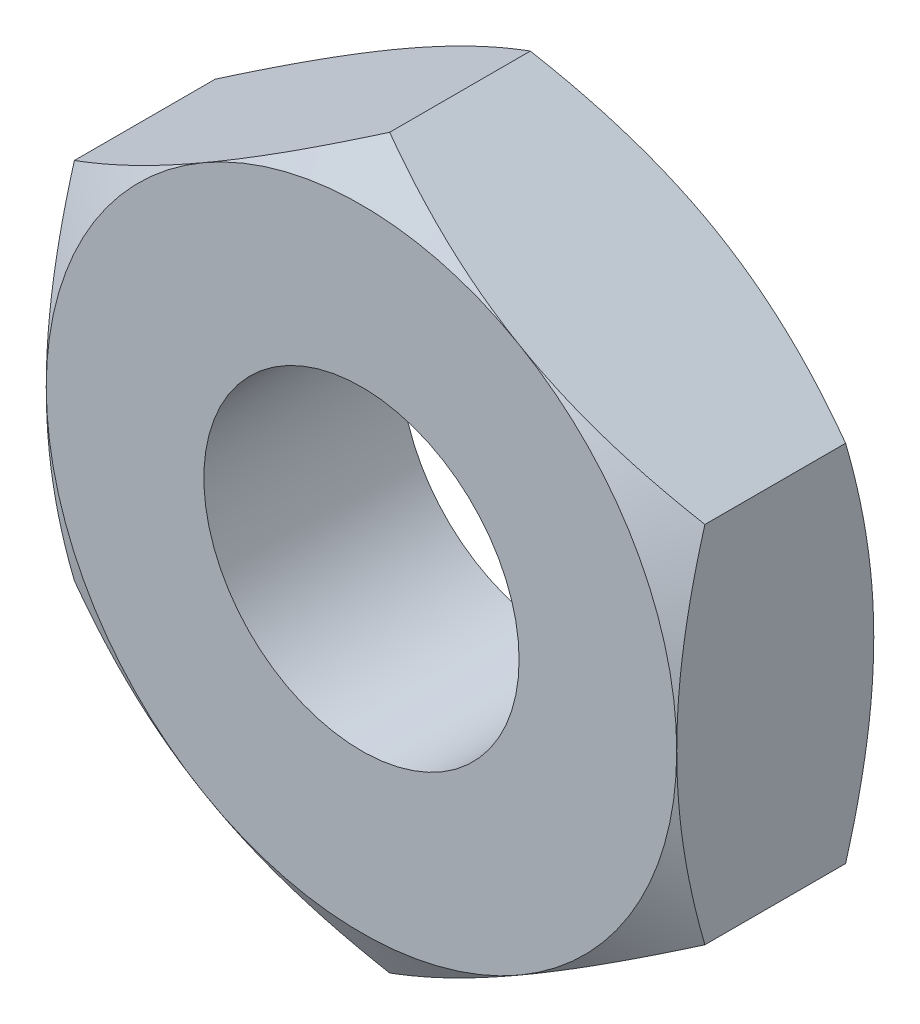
from build123d import *

# Parameters (mm, degrees)
BASE_EXTRUSION_DEPTH    = 5
ESQUISSE3_R             = 5
ENL_V_MAT_EXTRU_1_DEPTH = 14.20353488
ESQUISSE4_R             = 5
ESQUISSE4_R_2           = 4
BOSS_EXTRU_1_DEPTH      = 5


with BuildPart() as part:
    # Esquisse1 → Base-Extrusion (new body)
    with BuildSketch(Plane.XY):
        Polygon((8, -4.618802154), (8, 4.618802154), (0, 9.237604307), (-8, 4.618802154), (-8, -4.618802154), (0, -9.237604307), align=None)
    extrude(amount=-BASE_EXTRUSION_DEPTH)

    # Esquisse2 → Enl_vement de mati_re-R_volution1 (revolve, cut)
    with BuildSketch(Plane(origin=(0, 0, 0), x_dir=(1, 0, 0), z_dir=(0, 1, 0))):
        Polygon((-8, 0), (-13.330127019, 0), (-13.330127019, 5), (-8, 5), (-12.330127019, 2.5), align=None)
    revolve(axis=Axis((0, 0, -5), (0, 0, 1)), mode=Mode.SUBTRACT)

    # Esquisse3 → Enl_v. mat.-Extru.1 (cut, through all)
    with BuildSketch(Plane.XY):
        Circle(ESQUISSE3_R)
    extrude(amount=-ENL_V_MAT_EXTRU_1_DEPTH, mode=Mode.SUBTRACT)

    # Esquisse4 → Boss.-Extru.1 (add)
    with BuildSketch(Plane.XY):
        Circle(ESQUISSE4_R)
        Circle(ESQUISSE4_R_2, mode=Mode.SUBTRACT)
    extrude(amount=-BOSS_EXTRU_1_DEPTH)


solid = part.part
